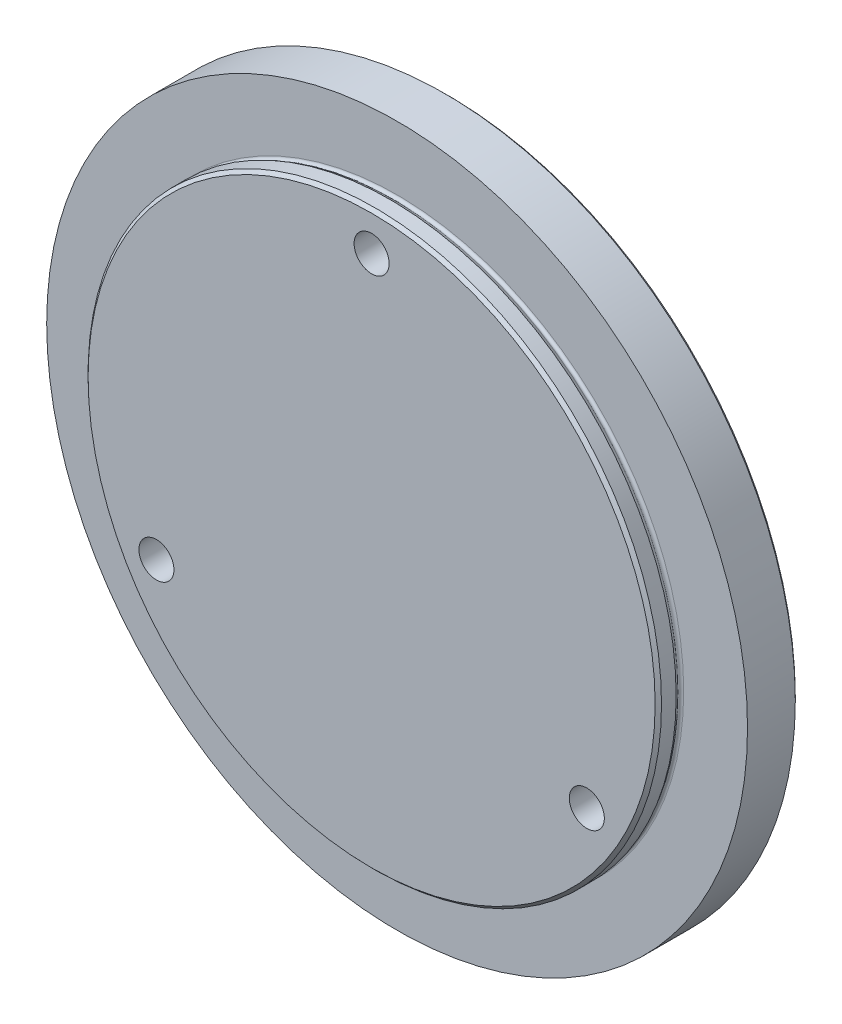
ISO-10303-21;
HEADER;
FILE_DESCRIPTION(('STEP AP214'),'2;1');
FILE_NAME('part.step','',(''),(''),'','','');
FILE_SCHEMA(('AUTOMOTIVE_DESIGN { 1 0 10303 214 1 1 1 1 }'));
ENDSEC;
DATA;
#1=APPLICATION_CONTEXT('core data for automotive mechanical design processes');
#2=APPLICATION_PROTOCOL_DEFINITION('international standard','automotive_design',2000,#1);
#3=PRODUCT_CONTEXT('',#1,'mechanical');
#4=PRODUCT('Part','Part','',(#3));
#5=PRODUCT_RELATED_PRODUCT_CATEGORY('part','',(#4));
#6=PRODUCT_DEFINITION_FORMATION('','',#4);
#7=PRODUCT_DEFINITION_CONTEXT('part definition',#1,'design');
#8=PRODUCT_DEFINITION('design','',#6,#7);
#9=PRODUCT_DEFINITION_SHAPE('','',#8);
#10=(LENGTH_UNIT() NAMED_UNIT(*) SI_UNIT(.MILLI.,.METRE.));
#11=(NAMED_UNIT(*) PLANE_ANGLE_UNIT() SI_UNIT($,.RADIAN.));
#12=(NAMED_UNIT(*) SI_UNIT($,.STERADIAN.) SOLID_ANGLE_UNIT());
#13=UNCERTAINTY_MEASURE_WITH_UNIT(LENGTH_MEASURE(1.E-05),#10,'distance_accuracy_value','');
#14=(GEOMETRIC_REPRESENTATION_CONTEXT(3) GLOBAL_UNCERTAINTY_ASSIGNED_CONTEXT((#13)) GLOBAL_UNIT_ASSIGNED_CONTEXT((#10,
#11,#12)) REPRESENTATION_CONTEXT('',''));
#15=CARTESIAN_POINT('',(0.,0.,0.));
#16=DIRECTION('',(0.,0.,1.));
#17=DIRECTION('',(1.,0.,0.));
#18=AXIS2_PLACEMENT_3D('',#15,#16,#17);
#19=CARTESIAN_POINT('',(0.,45.,0.));
#20=DIRECTION('',(0.,0.,-1.));
#21=DIRECTION('',(-1.,0.,0.));
#22=AXIS2_PLACEMENT_3D('',#19,#20,#21);
#23=PLANE('',#22);
#24=CARTESIAN_POINT('',(0.,0.,0.));
#25=DIRECTION('',(0.,0.,1.));
#26=DIRECTION('',(1.,0.,0.));
#27=AXIS2_PLACEMENT_3D('',#24,#25,#26);
#28=CIRCLE('',#27,55.);
#29=CARTESIAN_POINT('',(55.,0.,0.));
#30=VERTEX_POINT('',#29);
#31=EDGE_CURVE('E45',#30,#30,#28,.T.);
#32=ORIENTED_EDGE('',*,*,#31,.T.);
#33=EDGE_LOOP('',(#32));
#34=FACE_BOUND('',#33,.T.);
#35=CARTESIAN_POINT('',(0.,0.,0.));
#36=DIRECTION('',(0.,0.,1.));
#37=DIRECTION('',(1.,0.,0.));
#38=AXIS2_PLACEMENT_3D('',#35,#36,#37);
#39=CIRCLE('',#38,44.9859648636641);
#40=CARTESIAN_POINT('',(44.9859648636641,0.,0.));
#41=VERTEX_POINT('',#40);
#42=EDGE_CURVE('E57',#41,#41,#39,.T.);
#43=ORIENTED_EDGE('',*,*,#42,.F.);
#44=EDGE_LOOP('',(#43));
#45=FACE_BOUND('',#44,.T.);
#46=ADVANCED_FACE('F34',(#34,#45),#23,.F.);
#47=CARTESIAN_POINT('',(0.,0.,-8.));
#48=DIRECTION('',(0.,0.,1.));
#49=DIRECTION('',(1.,0.,0.));
#50=AXIS2_PLACEMENT_3D('',#47,#48,#49);
#51=CYLINDRICAL_SURFACE('',#50,55.);
#52=ORIENTED_EDGE('',*,*,#31,.F.);
#53=EDGE_LOOP('',(#52));
#54=FACE_BOUND('',#53,.T.);
#55=CARTESIAN_POINT('',(0.,0.,-7.49999999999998));
#56=DIRECTION('',(0.,0.,1.));
#57=DIRECTION('',(1.,0.,0.));
#58=AXIS2_PLACEMENT_3D('',#55,#56,#57);
#59=CIRCLE('',#58,55.);
#60=CARTESIAN_POINT('',(55.,0.,-7.49999999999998));
#61=VERTEX_POINT('',#60);
#62=EDGE_CURVE('E49',#61,#61,#59,.T.);
#63=ORIENTED_EDGE('',*,*,#62,.T.);
#64=EDGE_LOOP('',(#63));
#65=FACE_BOUND('',#64,.T.);
#66=ADVANCED_FACE('F117',(#54,#65),#51,.T.);
#67=CARTESIAN_POINT('',(0.,0.,-7.99999999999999));
#68=DIRECTION('',(0.,0.,1.));
#69=DIRECTION('',(1.,0.,0.));
#70=AXIS2_PLACEMENT_3D('',#67,#68,#69);
#71=CONICAL_SURFACE('',#70,54.5,0.785398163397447);
#72=ORIENTED_EDGE('',*,*,#62,.F.);
#73=EDGE_LOOP('',(#72));
#74=FACE_BOUND('',#73,.T.);
#75=CARTESIAN_POINT('',(0.,0.,-7.99999999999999));
#76=DIRECTION('',(0.,0.,1.));
#77=DIRECTION('',(1.,0.,0.));
#78=AXIS2_PLACEMENT_3D('',#75,#76,#77);
#79=CIRCLE('',#78,54.5);
#80=CARTESIAN_POINT('',(54.5,0.,-7.99999999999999));
#81=VERTEX_POINT('',#80);
#82=EDGE_CURVE('E54',#81,#81,#79,.T.);
#83=ORIENTED_EDGE('',*,*,#82,.T.);
#84=EDGE_LOOP('',(#83));
#85=FACE_BOUND('',#84,.T.);
#86=ADVANCED_FACE('F109',(#74,#85),#71,.T.);
#87=CARTESIAN_POINT('',(0.,0.,-8.));
#88=DIRECTION('',(0.,0.,1.));
#89=DIRECTION('',(1.,0.,0.));
#90=AXIS2_PLACEMENT_3D('',#87,#88,#89);
#91=PLANE('',#90);
#92=CARTESIAN_POINT('',(0.,39.,-8.));
#93=DIRECTION('',(0.,0.,-1.));
#94=DIRECTION('',(-1.,0.,0.));
#95=AXIS2_PLACEMENT_3D('',#92,#93,#94);
#96=CIRCLE('',#95,5.);
#97=CARTESIAN_POINT('',(-5.00000000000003,39.,-8.));
#98=VERTEX_POINT('',#97);
#99=EDGE_CURVE('E99',#98,#98,#96,.T.);
#100=ORIENTED_EDGE('',*,*,#99,.F.);
#101=EDGE_LOOP('',(#100));
#102=FACE_BOUND('',#101,.T.);
#103=CARTESIAN_POINT('',(-33.7749907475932,-19.5,-8.));
#104=DIRECTION('',(0.,0.,-1.));
#105=DIRECTION('',(-1.,0.,0.));
#106=AXIS2_PLACEMENT_3D('',#103,#104,#105);
#107=CIRCLE('',#106,5.);
#108=CARTESIAN_POINT('',(-38.7749907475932,-19.5,-8.));
#109=VERTEX_POINT('',#108);
#110=EDGE_CURVE('E87',#109,#109,#107,.T.);
#111=ORIENTED_EDGE('',*,*,#110,.F.);
#112=EDGE_LOOP('',(#111));
#113=FACE_BOUND('',#112,.T.);
#114=CARTESIAN_POINT('',(33.7749907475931,-19.5,-8.));
#115=DIRECTION('',(0.,0.,-1.));
#116=DIRECTION('',(-1.,0.,0.));
#117=AXIS2_PLACEMENT_3D('',#114,#115,#116);
#118=CIRCLE('',#117,5.);
#119=CARTESIAN_POINT('',(28.7749907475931,-19.5,-8.));
#120=VERTEX_POINT('',#119);
#121=EDGE_CURVE('E75',#120,#120,#118,.T.);
#122=ORIENTED_EDGE('',*,*,#121,.F.);
#123=EDGE_LOOP('',(#122));
#124=FACE_BOUND('',#123,.T.);
#125=ORIENTED_EDGE('',*,*,#82,.F.);
#126=EDGE_LOOP('',(#125));
#127=FACE_BOUND('',#126,.T.);
#128=ADVANCED_FACE('F105',(#102,#113,#124,#127),#91,.F.);
#129=CARTESIAN_POINT('',(0.,0.,0.400000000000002));
#130=DIRECTION('',(0.,0.,1.));
#131=DIRECTION('',(1.,0.,0.));
#132=AXIS2_PLACEMENT_3D('',#129,#130,#131);
#133=TOROIDAL_SURFACE('',#132,44.9859648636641,0.400000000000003);
#134=ORIENTED_EDGE('',*,*,#42,.T.);
#135=EDGE_LOOP('',(#134));
#136=FACE_BOUND('',#135,.T.);
#137=CARTESIAN_POINT('',(0.,0.,0.606015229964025));
#138=DIRECTION('',(0.,0.,1.));
#139=DIRECTION('',(1.,0.,0.));
#140=AXIS2_PLACEMENT_3D('',#137,#138,#139);
#141=CIRCLE('',#140,44.6430979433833);
#142=CARTESIAN_POINT('',(44.6430979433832,0.,0.606015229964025));
#143=VERTEX_POINT('',#142);
#144=EDGE_CURVE('E60',#143,#143,#141,.T.);
#145=ORIENTED_EDGE('',*,*,#144,.F.);
#146=EDGE_LOOP('',(#145));
#147=FACE_BOUND('',#146,.T.);
#148=ADVANCED_FACE('F108',(#136,#147),#133,.F.);
#149=CARTESIAN_POINT('',(0.,0.,1.2));
#150=DIRECTION('',(0.,0.,1.));
#151=DIRECTION('',(1.,0.,0.));
#152=AXIS2_PLACEMENT_3D('',#149,#150,#151);
#153=CONICAL_SURFACE('',#152,45.,0.541052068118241);
#154=ORIENTED_EDGE('',*,*,#144,.T.);
#155=EDGE_LOOP('',(#154));
#156=FACE_BOUND('',#155,.T.);
#157=CARTESIAN_POINT('',(0.,0.,1.2));
#158=DIRECTION('',(0.,0.,1.));
#159=DIRECTION('',(1.,0.,0.));
#160=AXIS2_PLACEMENT_3D('',#157,#158,#159);
#161=CIRCLE('',#160,45.);
#162=CARTESIAN_POINT('',(45.,0.,1.2));
#163=VERTEX_POINT('',#162);
#164=EDGE_CURVE('E63',#163,#163,#161,.T.);
#165=ORIENTED_EDGE('',*,*,#164,.F.);
#166=EDGE_LOOP('',(#165));
#167=FACE_BOUND('',#166,.T.);
#168=ADVANCED_FACE('F151',(#156,#167),#153,.T.);
#169=CARTESIAN_POINT('',(0.,44.5,4.));
#170=DIRECTION('',(0.,0.,-1.));
#171=DIRECTION('',(-1.,0.,0.));
#172=AXIS2_PLACEMENT_3D('',#169,#170,#171);
#173=PLANE('',#172);
#174=CARTESIAN_POINT('',(0.,39.,4.));
#175=DIRECTION('',(0.,0.,-1.));
#176=DIRECTION('',(-1.,0.,0.));
#177=AXIS2_PLACEMENT_3D('',#174,#175,#176);
#178=CIRCLE('',#177,2.75);
#179=CARTESIAN_POINT('',(-2.75000000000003,39.,4.));
#180=VERTEX_POINT('',#179);
#181=EDGE_CURVE('E90',#180,#180,#178,.T.);
#182=ORIENTED_EDGE('',*,*,#181,.T.);
#183=EDGE_LOOP('',(#182));
#184=FACE_BOUND('',#183,.T.);
#185=CARTESIAN_POINT('',(-33.7749907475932,-19.5,4.));
#186=DIRECTION('',(0.,0.,-1.));
#187=DIRECTION('',(-1.,0.,0.));
#188=AXIS2_PLACEMENT_3D('',#185,#186,#187);
#189=CIRCLE('',#188,2.75);
#190=CARTESIAN_POINT('',(-36.5249907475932,-19.5,4.));
#191=VERTEX_POINT('',#190);
#192=EDGE_CURVE('E78',#191,#191,#189,.T.);
#193=ORIENTED_EDGE('',*,*,#192,.T.);
#194=EDGE_LOOP('',(#193));
#195=FACE_BOUND('',#194,.T.);
#196=CARTESIAN_POINT('',(33.7749907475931,-19.5,4.));
#197=DIRECTION('',(0.,0.,-1.));
#198=DIRECTION('',(-1.,0.,0.));
#199=AXIS2_PLACEMENT_3D('',#196,#197,#198);
#200=CIRCLE('',#199,2.75);
#201=CARTESIAN_POINT('',(31.0249907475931,-19.5,4.));
#202=VERTEX_POINT('',#201);
#203=EDGE_CURVE('E66',#202,#202,#200,.T.);
#204=ORIENTED_EDGE('',*,*,#203,.T.);
#205=EDGE_LOOP('',(#204));
#206=FACE_BOUND('',#205,.T.);
#207=CARTESIAN_POINT('',(0.,0.,4.));
#208=DIRECTION('',(0.,0.,1.));
#209=DIRECTION('',(1.,0.,0.));
#210=AXIS2_PLACEMENT_3D('',#207,#208,#209);
#211=CIRCLE('',#210,44.5);
#212=CARTESIAN_POINT('',(44.5,0.,4.));
#213=VERTEX_POINT('',#212);
#214=EDGE_CURVE('E41',#213,#213,#211,.T.);
#215=ORIENTED_EDGE('',*,*,#214,.T.);
#216=EDGE_LOOP('',(#215));
#217=FACE_BOUND('',#216,.T.);
#218=ADVANCED_FACE('F36',(#184,#195,#206,#217),#173,.F.);
#219=CARTESIAN_POINT('',(0.,0.,3.49999999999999));
#220=DIRECTION('',(0.,0.,-1.));
#221=DIRECTION('',(-1.,0.,0.));
#222=AXIS2_PLACEMENT_3D('',#219,#220,#221);
#223=CONICAL_SURFACE('',#222,45.,0.785398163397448);
#224=ORIENTED_EDGE('',*,*,#214,.F.);
#225=EDGE_LOOP('',(#224));
#226=FACE_BOUND('',#225,.T.);
#227=CARTESIAN_POINT('',(0.,0.,3.49999999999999));
#228=DIRECTION('',(0.,0.,1.));
#229=DIRECTION('',(1.,0.,0.));
#230=AXIS2_PLACEMENT_3D('',#227,#228,#229);
#231=CIRCLE('',#230,45.);
#232=CARTESIAN_POINT('',(45.,0.,3.49999999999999));
#233=VERTEX_POINT('',#232);
#234=EDGE_CURVE('E10',#233,#233,#231,.T.);
#235=ORIENTED_EDGE('',*,*,#234,.T.);
#236=EDGE_LOOP('',(#235));
#237=FACE_BOUND('',#236,.T.);
#238=ADVANCED_FACE('F134',(#226,#237),#223,.T.);
#239=CARTESIAN_POINT('',(0.,0.,-8.));
#240=DIRECTION('',(0.,0.,1.));
#241=DIRECTION('',(1.,0.,0.));
#242=AXIS2_PLACEMENT_3D('',#239,#240,#241);
#243=CYLINDRICAL_SURFACE('',#242,45.);
#244=ORIENTED_EDGE('',*,*,#234,.F.);
#245=EDGE_LOOP('',(#244));
#246=FACE_BOUND('',#245,.T.);
#247=ORIENTED_EDGE('',*,*,#164,.T.);
#248=EDGE_LOOP('',(#247));
#249=FACE_BOUND('',#248,.T.);
#250=ADVANCED_FACE('F137',(#246,#249),#243,.T.);
#251=CARTESIAN_POINT('',(33.7749907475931,-19.5,-8.));
#252=DIRECTION('',(0.,0.,-1.));
#253=DIRECTION('',(-1.,0.,0.));
#254=AXIS2_PLACEMENT_3D('',#251,#252,#253);
#255=CYLINDRICAL_SURFACE('',#254,2.75);
#256=ORIENTED_EDGE('',*,*,#203,.F.);
#257=EDGE_LOOP('',(#256));
#258=FACE_BOUND('',#257,.T.);
#259=CARTESIAN_POINT('',(33.7749907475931,-19.5,-2.3));
#260=DIRECTION('',(0.,0.,-1.));
#261=DIRECTION('',(-1.,0.,0.));
#262=AXIS2_PLACEMENT_3D('',#259,#260,#261);
#263=CIRCLE('',#262,2.75);
#264=CARTESIAN_POINT('',(31.0249907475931,-19.5,-2.3));
#265=VERTEX_POINT('',#264);
#266=EDGE_CURVE('E69',#265,#265,#263,.T.);
#267=ORIENTED_EDGE('',*,*,#266,.T.);
#268=EDGE_LOOP('',(#267));
#269=FACE_BOUND('',#268,.T.);
#270=ADVANCED_FACE('F140',(#258,#269),#255,.F.);
#271=CARTESIAN_POINT('',(36.5249907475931,-19.5,-2.3));
#272=DIRECTION('',(0.,0.,1.));
#273=DIRECTION('',(1.,0.,0.));
#274=AXIS2_PLACEMENT_3D('',#271,#272,#273);
#275=PLANE('',#274);
#276=ORIENTED_EDGE('',*,*,#266,.F.);
#277=EDGE_LOOP('',(#276));
#278=FACE_BOUND('',#277,.T.);
#279=CARTESIAN_POINT('',(33.7749907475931,-19.5,-2.3));
#280=DIRECTION('',(0.,0.,-1.));
#281=DIRECTION('',(-1.,0.,0.));
#282=AXIS2_PLACEMENT_3D('',#279,#280,#281);
#283=CIRCLE('',#282,5.);
#284=CARTESIAN_POINT('',(28.7749907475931,-19.5,-2.3));
#285=VERTEX_POINT('',#284);
#286=EDGE_CURVE('E72',#285,#285,#283,.T.);
#287=ORIENTED_EDGE('',*,*,#286,.T.);
#288=EDGE_LOOP('',(#287));
#289=FACE_BOUND('',#288,.T.);
#290=ADVANCED_FACE('F145',(#278,#289),#275,.F.);
#291=CARTESIAN_POINT('',(33.7749907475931,-19.5,-8.));
#292=DIRECTION('',(0.,0.,-1.));
#293=DIRECTION('',(-1.,0.,0.));
#294=AXIS2_PLACEMENT_3D('',#291,#292,#293);
#295=CYLINDRICAL_SURFACE('',#294,5.);
#296=ORIENTED_EDGE('',*,*,#286,.F.);
#297=EDGE_LOOP('',(#296));
#298=FACE_BOUND('',#297,.T.);
#299=ORIENTED_EDGE('',*,*,#121,.T.);
#300=EDGE_LOOP('',(#299));
#301=FACE_BOUND('',#300,.T.);
#302=ADVANCED_FACE('F164',(#298,#301),#295,.F.);
#303=CARTESIAN_POINT('',(-33.7749907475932,-19.5,-8.));
#304=DIRECTION('',(0.,0.,-1.));
#305=DIRECTION('',(-1.,0.,0.));
#306=AXIS2_PLACEMENT_3D('',#303,#304,#305);
#307=CYLINDRICAL_SURFACE('',#306,2.75);
#308=ORIENTED_EDGE('',*,*,#192,.F.);
#309=EDGE_LOOP('',(#308));
#310=FACE_BOUND('',#309,.T.);
#311=CARTESIAN_POINT('',(-33.7749907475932,-19.5,-2.3));
#312=DIRECTION('',(0.,0.,-1.));
#313=DIRECTION('',(-1.,0.,0.));
#314=AXIS2_PLACEMENT_3D('',#311,#312,#313);
#315=CIRCLE('',#314,2.75);
#316=CARTESIAN_POINT('',(-36.5249907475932,-19.5,-2.3));
#317=VERTEX_POINT('',#316);
#318=EDGE_CURVE('E81',#317,#317,#315,.T.);
#319=ORIENTED_EDGE('',*,*,#318,.T.);
#320=EDGE_LOOP('',(#319));
#321=FACE_BOUND('',#320,.T.);
#322=ADVANCED_FACE('F168',(#310,#321),#307,.F.);
#323=CARTESIAN_POINT('',(-31.0249907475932,-19.5,-2.3));
#324=DIRECTION('',(0.,0.,1.));
#325=DIRECTION('',(1.,0.,0.));
#326=AXIS2_PLACEMENT_3D('',#323,#324,#325);
#327=PLANE('',#326);
#328=ORIENTED_EDGE('',*,*,#318,.F.);
#329=EDGE_LOOP('',(#328));
#330=FACE_BOUND('',#329,.T.);
#331=CARTESIAN_POINT('',(-33.7749907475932,-19.5,-2.3));
#332=DIRECTION('',(0.,0.,-1.));
#333=DIRECTION('',(-1.,0.,0.));
#334=AXIS2_PLACEMENT_3D('',#331,#332,#333);
#335=CIRCLE('',#334,5.);
#336=CARTESIAN_POINT('',(-38.7749907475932,-19.5,-2.3));
#337=VERTEX_POINT('',#336);
#338=EDGE_CURVE('E84',#337,#337,#335,.T.);
#339=ORIENTED_EDGE('',*,*,#338,.T.);
#340=EDGE_LOOP('',(#339));
#341=FACE_BOUND('',#340,.T.);
#342=ADVANCED_FACE('F172',(#330,#341),#327,.F.);
#343=CARTESIAN_POINT('',(-33.7749907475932,-19.5,-8.));
#344=DIRECTION('',(0.,0.,-1.));
#345=DIRECTION('',(-1.,0.,0.));
#346=AXIS2_PLACEMENT_3D('',#343,#344,#345);
#347=CYLINDRICAL_SURFACE('',#346,5.);
#348=ORIENTED_EDGE('',*,*,#338,.F.);
#349=EDGE_LOOP('',(#348));
#350=FACE_BOUND('',#349,.T.);
#351=ORIENTED_EDGE('',*,*,#110,.T.);
#352=EDGE_LOOP('',(#351));
#353=FACE_BOUND('',#352,.T.);
#354=ADVANCED_FACE('F176',(#350,#353),#347,.F.);
#355=CARTESIAN_POINT('',(0.,39.,-8.));
#356=DIRECTION('',(0.,0.,-1.));
#357=DIRECTION('',(-1.,0.,0.));
#358=AXIS2_PLACEMENT_3D('',#355,#356,#357);
#359=CYLINDRICAL_SURFACE('',#358,2.75);
#360=ORIENTED_EDGE('',*,*,#181,.F.);
#361=EDGE_LOOP('',(#360));
#362=FACE_BOUND('',#361,.T.);
#363=CARTESIAN_POINT('',(0.,39.,-2.3));
#364=DIRECTION('',(0.,0.,-1.));
#365=DIRECTION('',(-1.,0.,0.));
#366=AXIS2_PLACEMENT_3D('',#363,#364,#365);
#367=CIRCLE('',#366,2.75);
#368=CARTESIAN_POINT('',(-2.75000000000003,39.,-2.3));
#369=VERTEX_POINT('',#368);
#370=EDGE_CURVE('E93',#369,#369,#367,.T.);
#371=ORIENTED_EDGE('',*,*,#370,.T.);
#372=EDGE_LOOP('',(#371));
#373=FACE_BOUND('',#372,.T.);
#374=ADVANCED_FACE('F180',(#362,#373),#359,.F.);
#375=CARTESIAN_POINT('',(2.74999999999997,39.,-2.3));
#376=DIRECTION('',(0.,0.,1.));
#377=DIRECTION('',(1.,0.,0.));
#378=AXIS2_PLACEMENT_3D('',#375,#376,#377);
#379=PLANE('',#378);
#380=ORIENTED_EDGE('',*,*,#370,.F.);
#381=EDGE_LOOP('',(#380));
#382=FACE_BOUND('',#381,.T.);
#383=CARTESIAN_POINT('',(0.,39.,-2.3));
#384=DIRECTION('',(0.,0.,-1.));
#385=DIRECTION('',(-1.,0.,0.));
#386=AXIS2_PLACEMENT_3D('',#383,#384,#385);
#387=CIRCLE('',#386,5.);
#388=CARTESIAN_POINT('',(-5.00000000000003,39.,-2.3));
#389=VERTEX_POINT('',#388);
#390=EDGE_CURVE('E96',#389,#389,#387,.T.);
#391=ORIENTED_EDGE('',*,*,#390,.T.);
#392=EDGE_LOOP('',(#391));
#393=FACE_BOUND('',#392,.T.);
#394=ADVANCED_FACE('F184',(#382,#393),#379,.F.);
#395=CARTESIAN_POINT('',(0.,39.,-8.));
#396=DIRECTION('',(0.,0.,-1.));
#397=DIRECTION('',(-1.,0.,0.));
#398=AXIS2_PLACEMENT_3D('',#395,#396,#397);
#399=CYLINDRICAL_SURFACE('',#398,5.);
#400=ORIENTED_EDGE('',*,*,#390,.F.);
#401=EDGE_LOOP('',(#400));
#402=FACE_BOUND('',#401,.T.);
#403=ORIENTED_EDGE('',*,*,#99,.T.);
#404=EDGE_LOOP('',(#403));
#405=FACE_BOUND('',#404,.T.);
#406=ADVANCED_FACE('F103',(#402,#405),#399,.F.);
#407=CLOSED_SHELL('',(#46,#66,#86,#128,#148,#168,#218,#238,#250,#270,#290,#302,#322,#342,#354,
#374,#394,#406));
#408=MANIFOLD_SOLID_BREP('B2',#407);
#409=ADVANCED_BREP_SHAPE_REPRESENTATION('',(#18,#408),#14);
#410=SHAPE_DEFINITION_REPRESENTATION(#9,#409);
ENDSEC;
END-ISO-10303-21;
